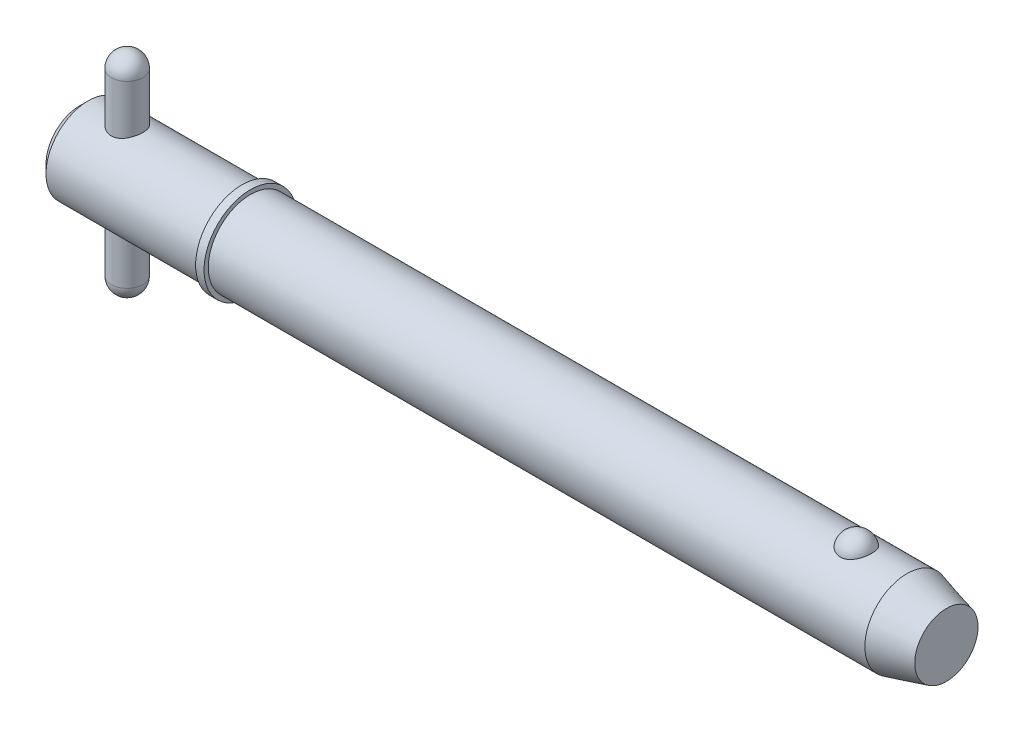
ISO-10303-21;
HEADER;
FILE_DESCRIPTION(('STEP AP214'),'2;1');
FILE_NAME('part.step','',(''),(''),'','','');
FILE_SCHEMA(('AUTOMOTIVE_DESIGN { 1 0 10303 214 1 1 1 1 }'));
ENDSEC;
DATA;
#1=APPLICATION_CONTEXT('core data for automotive mechanical design processes');
#2=APPLICATION_PROTOCOL_DEFINITION('international standard','automotive_design',2000,#1);
#3=PRODUCT_CONTEXT('',#1,'mechanical');
#4=PRODUCT('Part','Part','',(#3));
#5=PRODUCT_RELATED_PRODUCT_CATEGORY('part','',(#4));
#6=PRODUCT_DEFINITION_FORMATION('','',#4);
#7=PRODUCT_DEFINITION_CONTEXT('part definition',#1,'design');
#8=PRODUCT_DEFINITION('design','',#6,#7);
#9=PRODUCT_DEFINITION_SHAPE('','',#8);
#10=(LENGTH_UNIT() NAMED_UNIT(*) SI_UNIT(.MILLI.,.METRE.));
#11=(NAMED_UNIT(*) PLANE_ANGLE_UNIT() SI_UNIT($,.RADIAN.));
#12=(NAMED_UNIT(*) SI_UNIT($,.STERADIAN.) SOLID_ANGLE_UNIT());
#13=UNCERTAINTY_MEASURE_WITH_UNIT(LENGTH_MEASURE(1.E-05),#10,'distance_accuracy_value','');
#14=(GEOMETRIC_REPRESENTATION_CONTEXT(3) GLOBAL_UNCERTAINTY_ASSIGNED_CONTEXT((#13)) GLOBAL_UNIT_ASSIGNED_CONTEXT((#10,
#11,#12)) REPRESENTATION_CONTEXT('',''));
#15=CARTESIAN_POINT('',(0.,0.,0.));
#16=DIRECTION('',(0.,0.,1.));
#17=DIRECTION('',(1.,0.,0.));
#18=AXIS2_PLACEMENT_3D('',#15,#16,#17);
#19=CARTESIAN_POINT('',(7.14,15.875,0.));
#20=DIRECTION('',(0.,-1.,0.));
#21=DIRECTION('',(0.,0.,-1.));
#22=AXIS2_PLACEMENT_3D('',#19,#20,#21);
#23=CYLINDRICAL_SURFACE('',#22,2.38);
#24=CARTESIAN_POINT('',(7.14,-13.495,0.));
#25=DIRECTION('',(0.,-1.,0.));
#26=DIRECTION('',(0.,0.,-1.));
#27=AXIS2_PLACEMENT_3D('',#24,#25,#26);
#28=CIRCLE('',#27,2.38);
#29=CARTESIAN_POINT('',(7.14,-13.495,-2.38));
#30=VERTEX_POINT('',#29);
#31=EDGE_CURVE('P0_E10',#30,#30,#28,.F.);
#32=ORIENTED_EDGE('',*,*,#31,.T.);
#33=EDGE_LOOP('',(#32));
#34=FACE_BOUND('',#33,.T.);
#35=CARTESIAN_POINT('',(7.14,13.495,0.));
#36=DIRECTION('',(0.,-1.,0.));
#37=DIRECTION('',(0.,0.,-1.));
#38=AXIS2_PLACEMENT_3D('',#35,#36,#37);
#39=CIRCLE('',#38,2.38);
#40=CARTESIAN_POINT('',(7.14,13.495,-2.38));
#41=VERTEX_POINT('',#40);
#42=EDGE_CURVE('P0_E21',#41,#41,#39,.T.);
#43=ORIENTED_EDGE('',*,*,#42,.T.);
#44=EDGE_LOOP('',(#43));
#45=FACE_BOUND('',#44,.T.);
#46=ADVANCED_FACE('P0_F14',(#34,#45),#23,.T.);
#47=CARTESIAN_POINT('',(7.14,-13.495,0.));
#48=DIRECTION('',(0.,0.,1.));
#49=DIRECTION('',(1.,0.,0.));
#50=AXIS2_PLACEMENT_3D('',#47,#48,#49);
#51=SPHERICAL_SURFACE('',#50,2.38);
#52=CARTESIAN_POINT('',(7.14,-13.495,0.));
#53=DIRECTION('',(0.,-1.,0.));
#54=DIRECTION('',(0.,0.,-1.));
#55=AXIS2_PLACEMENT_3D('',#52,#53,#54);
#56=SPHERICAL_SURFACE('',#55,2.38);
#57=ORIENTED_EDGE('',*,*,#31,.F.);
#58=EDGE_LOOP('',(#57));
#59=FACE_BOUND('',#58,.T.);
#60=ADVANCED_FACE('P0_F29',(#59),#56,.T.);
#61=CARTESIAN_POINT('',(7.14,13.495,0.));
#62=DIRECTION('',(0.,0.,1.));
#63=DIRECTION('',(1.,0.,0.));
#64=AXIS2_PLACEMENT_3D('',#61,#62,#63);
#65=SPHERICAL_SURFACE('',#64,2.38);
#66=CARTESIAN_POINT('',(7.14,13.495,0.));
#67=DIRECTION('',(0.,-1.,0.));
#68=DIRECTION('',(0.,0.,-1.));
#69=AXIS2_PLACEMENT_3D('',#66,#67,#68);
#70=SPHERICAL_SURFACE('',#69,2.38);
#71=ORIENTED_EDGE('',*,*,#42,.F.);
#72=EDGE_LOOP('',(#71));
#73=FACE_BOUND('',#72,.T.);
#74=ADVANCED_FACE('P0_F16',(#73),#70,.T.);
#75=CLOSED_SHELL('',(#46,#60,#74));
#76=MANIFOLD_SOLID_BREP('P0_B1',#75);
#77=CARTESIAN_POINT('',(0.,0.,0.));
#78=DIRECTION('',(1.,0.,0.));
#79=DIRECTION('',(0.,0.,-1.));
#80=AXIS2_PLACEMENT_3D('',#77,#78,#79);
#81=CYLINDRICAL_SURFACE('',#80,6.35);
#82=CARTESIAN_POINT('',(124.555369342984,0.,0.));
#83=DIRECTION('',(1.,0.,0.));
#84=DIRECTION('',(0.,0.,-1.));
#85=AXIS2_PLACEMENT_3D('',#82,#83,#84);
#86=CIRCLE('',#85,6.35);
#87=CARTESIAN_POINT('',(124.555369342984,0.,-6.35));
#88=VERTEX_POINT('',#87);
#89=EDGE_CURVE('P1_E81',#88,#88,#86,.T.);
#90=ORIENTED_EDGE('',*,*,#89,.F.);
#91=EDGE_LOOP('',(#90));
#92=FACE_BOUND('',#91,.T.);
#93=CARTESIAN_POINT('',(25.7,0.,0.));
#94=DIRECTION('',(1.,0.,0.));
#95=DIRECTION('',(0.,0.,-1.));
#96=AXIS2_PLACEMENT_3D('',#93,#94,#95);
#97=CIRCLE('',#96,6.35);
#98=CARTESIAN_POINT('',(25.7,0.,-6.35));
#99=VERTEX_POINT('',#98);
#100=EDGE_CURVE('P1_E85',#99,#99,#97,.T.);
#101=ORIENTED_EDGE('',*,*,#100,.T.);
#102=EDGE_LOOP('',(#101));
#103=FACE_BOUND('',#102,.T.);
#104=CARTESIAN_POINT('',(116.930021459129,5.87502187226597,2.40969251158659));
#105=CARTESIAN_POINT('',(116.805030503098,5.87501645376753,2.40969773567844));
#106=CARTESIAN_POINT('',(116.680080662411,5.87916061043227,2.39967292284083));
#107=CARTESIAN_POINT('',(116.433909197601,5.8952311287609,2.35991730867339));
#108=CARTESIAN_POINT('',(116.312686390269,5.90715499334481,2.33019283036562));
#109=CARTESIAN_POINT('',(116.077517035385,5.93739567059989,2.25201402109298));
#110=CARTESIAN_POINT('',(115.963560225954,5.95570321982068,2.2035868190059));
#111=CARTESIAN_POINT('',(115.74557352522,5.99672067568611,2.08937987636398));
#112=CARTESIAN_POINT('',(115.641545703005,6.01943149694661,2.02359652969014));
#113=CARTESIAN_POINT('',(115.442943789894,6.06760647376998,1.87428969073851));
#114=CARTESIAN_POINT('',(115.348726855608,6.09313095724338,1.79031110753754));
#115=CARTESIAN_POINT('',(115.175255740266,6.14375873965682,1.60800178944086));
#116=CARTESIAN_POINT('',(115.096004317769,6.16886196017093,1.50966841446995));
#117=CARTESIAN_POINT('',(114.950845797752,6.21724600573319,1.29645884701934));
#118=CARTESIAN_POINT('',(114.885688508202,6.24039621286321,1.18104158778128));
#119=CARTESIAN_POINT('',(114.774703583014,6.28117277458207,0.940351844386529));
#120=CARTESIAN_POINT('',(114.728877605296,6.29879865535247,0.815078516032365));
#121=CARTESIAN_POINT('',(114.657023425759,6.32692073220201,0.556494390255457));
#122=CARTESIAN_POINT('',(114.631249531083,6.33732517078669,0.423102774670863));
#123=CARTESIAN_POINT('',(114.600988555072,6.34957673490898,0.153542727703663));
#124=CARTESIAN_POINT('',(114.596500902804,6.35142408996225,0.0173743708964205));
#125=CARTESIAN_POINT('',(114.608865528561,6.34638925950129,-0.253036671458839));
#126=CARTESIAN_POINT('',(114.625594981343,6.33955731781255,-0.387285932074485));
#127=CARTESIAN_POINT('',(114.679843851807,6.31794129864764,-0.650851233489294));
#128=CARTESIAN_POINT('',(114.717363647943,6.30315707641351,-0.780167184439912));
#129=CARTESIAN_POINT('',(114.812500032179,6.26711642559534,-1.03041949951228));
#130=CARTESIAN_POINT('',(114.870143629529,6.24585130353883,-1.15134433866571));
#131=CARTESIAN_POINT('',(115.004352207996,6.19905619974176,-1.38129800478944));
#132=CARTESIAN_POINT('',(115.080918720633,6.17352587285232,-1.49032586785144));
#133=CARTESIAN_POINT('',(115.251753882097,6.12080227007,-1.69393164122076));
#134=CARTESIAN_POINT('',(115.346100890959,6.09360200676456,-1.78844209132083));
#135=CARTESIAN_POINT('',(115.550119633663,6.04070434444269,-1.95970536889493));
#136=CARTESIAN_POINT('',(115.659790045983,6.01500681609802,-2.03645972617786));
#137=CARTESIAN_POINT('',(115.889187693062,5.96867714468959,-2.1684564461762));
#138=CARTESIAN_POINT('',(116.008652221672,5.94794910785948,-2.2241206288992));
#139=CARTESIAN_POINT('',(116.256218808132,5.91340580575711,-2.31440992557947));
#140=CARTESIAN_POINT('',(116.384317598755,5.89958794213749,-2.34904294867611));
#141=CARTESIAN_POINT('',(116.638582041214,5.88111049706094,-2.39491590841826));
#142=CARTESIAN_POINT('',(116.764520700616,5.87602512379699,-2.40724512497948));
#143=CARTESIAN_POINT('',(117.016786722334,5.87428980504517,-2.41147867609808));
#144=CARTESIAN_POINT('',(117.143114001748,5.87763817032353,-2.40338710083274));
#145=CARTESIAN_POINT('',(117.388417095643,5.89212921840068,-2.36762715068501));
#146=CARTESIAN_POINT('',(117.507499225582,5.90302431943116,-2.34058030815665));
#147=CARTESIAN_POINT('',(117.73924472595,5.93113752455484,-2.26839066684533));
#148=CARTESIAN_POINT('',(117.851907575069,5.94835614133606,-2.22324640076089));
#149=CARTESIAN_POINT('',(118.070400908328,5.98773016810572,-2.11493806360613));
#150=CARTESIAN_POINT('',(118.176028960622,6.00998499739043,-2.05140269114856));
#151=CARTESIAN_POINT('',(118.375300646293,6.05690144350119,-1.90842705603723));
#152=CARTESIAN_POINT('',(118.468941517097,6.08156361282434,-1.8289831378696));
#153=CARTESIAN_POINT('',(118.646675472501,6.13211715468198,-1.65182429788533));
#154=CARTESIAN_POINT('',(118.730055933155,6.15800825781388,-1.55339381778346));
#155=CARTESIAN_POINT('',(118.879790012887,6.20712834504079,-1.34374214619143));
#156=CARTESIAN_POINT('',(118.946140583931,6.23035685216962,-1.23251867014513));
#157=CARTESIAN_POINT('',(119.062345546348,6.27251177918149,-0.99644720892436));
#158=CARTESIAN_POINT('',(119.111607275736,6.29127762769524,-0.871278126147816));
#159=CARTESIAN_POINT('',(119.189614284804,6.3215862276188,-0.613870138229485));
#160=CARTESIAN_POINT('',(119.218359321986,6.33312889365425,-0.481631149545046));
#161=CARTESIAN_POINT('',(119.25477058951,6.34782349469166,-0.213672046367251));
#162=CARTESIAN_POINT('',(119.262413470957,6.35096613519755,-0.0779482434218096));
#163=CARTESIAN_POINT('',(119.256395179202,6.34851322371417,0.192943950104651));
#164=CARTESIAN_POINT('',(119.242734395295,6.3429178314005,0.328112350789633));
#165=CARTESIAN_POINT('',(119.19450361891,6.32360512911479,0.593406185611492));
#166=CARTESIAN_POINT('',(119.160031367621,6.30992579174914,0.723552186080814));
#167=CARTESIAN_POINT('',(119.070953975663,6.27586325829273,0.975834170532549));
#168=CARTESIAN_POINT('',(119.01634761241,6.25547965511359,1.09796966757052));
#169=CARTESIAN_POINT('',(118.88775879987,6.20998183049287,1.33148921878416));
#170=CARTESIAN_POINT('',(118.813674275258,6.18484288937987,1.44281227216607));
#171=CARTESIAN_POINT('',(118.647820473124,6.13258735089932,1.65087683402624));
#172=CARTESIAN_POINT('',(118.556051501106,6.10547078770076,1.74761859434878));
#173=CARTESIAN_POINT('',(118.357183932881,6.0523587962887,1.92350926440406));
#174=CARTESIAN_POINT('',(118.250133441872,6.0263601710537,2.00271146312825));
#175=CARTESIAN_POINT('',(118.023138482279,5.97843747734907,2.14154159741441));
#176=CARTESIAN_POINT('',(117.903191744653,5.95651412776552,2.20116608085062));
#177=CARTESIAN_POINT('',(117.644523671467,5.91812106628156,2.30250570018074));
#178=CARTESIAN_POINT('',(117.50506980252,5.90217533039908,2.34256795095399));
#179=CARTESIAN_POINT('',(117.220397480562,5.88063128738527,2.39615214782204));
#180=CARTESIAN_POINT('',(117.07518174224,5.8750281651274,2.40968644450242));
#181=CARTESIAN_POINT('',(116.930021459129,5.87502187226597,2.40969251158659));
#182=B_SPLINE_CURVE_WITH_KNOTS('',3,(#104,#105,#106,#107,#108,#109,#110,#111,#112,#113,#114,
#115,#116,#117,#118,#119,#120,#121,#122,#123,#124,#125,#126,#127,#128,#129,#130,#131,#132,#133,
#134,#135,#136,#137,#138,#139,#140,#141,#142,#143,#144,#145,#146,#147,#148,#149,#150,#151,#152,
#153,#154,#155,#156,#157,#158,#159,#160,#161,#162,#163,#164,#165,#166,#167,#168,#169,#170,#171,
#172,#173,#174,#175,#176,#177,#178,#179,#180,#181),.UNSPECIFIED.,.T.,.F.,(4,2,2,2,2,2,2,2,2,2,2,
2,2,2,2,2,2,2,2,2,2,2,2,2,2,2,2,2,2,2,2,2,2,2,2,2,2,2,4),(0.,0.374440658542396,
0.748761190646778,1.12254078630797,1.49639810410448,1.88098871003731,2.26565013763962,
2.66741104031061,3.06920639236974,3.47601794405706,3.88281858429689,4.28727498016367,
4.69173873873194,5.09674745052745,5.50178895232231,5.90865911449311,6.31549420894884,
6.71369855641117,7.11175305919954,7.48978077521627,7.86773278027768,8.23383886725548,
8.59997464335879,8.97409044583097,9.34829231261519,9.74122667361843,10.1342313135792,
10.5397522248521,10.9452779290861,11.3512521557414,11.7572189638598,12.1612938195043,
12.5653932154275,12.9716540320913,13.3779078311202,13.7829098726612,14.1879832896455,
14.6230486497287,15.0579114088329),.UNSPECIFIED.);
#183=CARTESIAN_POINT('',(116.930021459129,5.87502187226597,2.40969251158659));
#184=VERTEX_POINT('',#183);
#185=EDGE_CURVE('P1_E35',#184,#184,#182,.T.);
#186=ORIENTED_EDGE('',*,*,#185,.T.);
#187=EDGE_LOOP('',(#186));
#188=FACE_BOUND('',#187,.T.);
#189=ADVANCED_FACE('P1_F13',(#92,#103,#188),#81,.T.);
#190=CARTESIAN_POINT('',(0.,0.,0.));
#191=DIRECTION('',(-1.,0.,0.));
#192=DIRECTION('',(0.,0.,1.));
#193=AXIS2_PLACEMENT_3D('',#190,#191,#192);
#194=PLANE('',#193);
#195=CARTESIAN_POINT('',(0.,0.,0.));
#196=DIRECTION('',(1.,0.,0.));
#197=DIRECTION('',(0.,0.,-1.));
#198=AXIS2_PLACEMENT_3D('',#195,#196,#197);
#199=CIRCLE('',#198,5.08);
#200=CARTESIAN_POINT('',(0.,0.,-5.08));
#201=VERTEX_POINT('',#200);
#202=EDGE_CURVE('P1_E9',#201,#201,#199,.T.);
#203=ORIENTED_EDGE('',*,*,#202,.F.);
#204=EDGE_LOOP('',(#203));
#205=FACE_BOUND('',#204,.T.);
#206=ADVANCED_FACE('P1_F15',(#205),#194,.T.);
#207=CARTESIAN_POINT('',(1.27,0.,0.));
#208=DIRECTION('',(1.,0.,0.));
#209=DIRECTION('',(0.,0.,-1.));
#210=AXIS2_PLACEMENT_3D('',#207,#208,#209);
#211=CONICAL_SURFACE('',#210,6.35,0.78539816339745);
#212=ORIENTED_EDGE('',*,*,#202,.T.);
#213=EDGE_LOOP('',(#212));
#214=FACE_BOUND('',#213,.T.);
#215=CARTESIAN_POINT('',(1.27,0.,0.));
#216=DIRECTION('',(1.,0.,0.));
#217=DIRECTION('',(0.,0.,-1.));
#218=AXIS2_PLACEMENT_3D('',#215,#216,#217);
#219=CIRCLE('',#218,6.35);
#220=CARTESIAN_POINT('',(1.27,0.,-6.35));
#221=VERTEX_POINT('',#220);
#222=EDGE_CURVE('P1_E26',#221,#221,#219,.T.);
#223=ORIENTED_EDGE('',*,*,#222,.F.);
#224=EDGE_LOOP('',(#223));
#225=FACE_BOUND('',#224,.T.);
#226=ADVANCED_FACE('P1_F77',(#214,#225),#211,.T.);
#227=CARTESIAN_POINT('',(0.,0.,0.));
#228=DIRECTION('',(1.,0.,0.));
#229=DIRECTION('',(0.,0.,-1.));
#230=AXIS2_PLACEMENT_3D('',#227,#228,#229);
#231=CYLINDRICAL_SURFACE('',#230,6.35);
#232=CARTESIAN_POINT('',(7.14,-5.88711304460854,2.38));
#233=CARTESIAN_POINT('',(7.01146258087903,-5.88710856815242,2.38000480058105));
#234=CARTESIAN_POINT('',(6.88295682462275,-5.89136840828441,2.36955244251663));
#235=CARTESIAN_POINT('',(6.62981934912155,-5.90782785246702,2.32820953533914));
#236=CARTESIAN_POINT('',(6.50518751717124,-5.92002722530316,2.29731958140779));
#237=CARTESIAN_POINT('',(6.26352403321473,-5.95079384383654,2.21639366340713));
#238=CARTESIAN_POINT('',(6.14647496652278,-5.96934583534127,2.16640353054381));
#239=CARTESIAN_POINT('',(5.92237941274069,-6.01070278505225,2.04885862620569));
#240=CARTESIAN_POINT('',(5.81533593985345,-6.03350901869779,1.98129858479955));
#241=CARTESIAN_POINT('',(5.60897525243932,-6.08207341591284,1.82693902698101));
#242=CARTESIAN_POINT('',(5.51022503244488,-6.10791836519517,1.73940861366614));
#243=CARTESIAN_POINT('',(5.32840561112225,-6.15892405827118,1.54914379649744));
#244=CARTESIAN_POINT('',(5.24533975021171,-6.1840846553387,1.44640616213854));
#245=CARTESIAN_POINT('',(5.09451639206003,-6.23191821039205,1.22434014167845));
#246=CARTESIAN_POINT('',(5.02737511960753,-6.25447755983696,1.10456656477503));
#247=CARTESIAN_POINT('',(4.91443001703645,-6.2935236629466,0.854429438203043));
#248=CARTESIAN_POINT('',(4.86861879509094,-6.31001251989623,0.724069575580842));
#249=CARTESIAN_POINT('',(4.80162253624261,-6.33444370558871,0.46242122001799));
#250=CARTESIAN_POINT('',(4.77946137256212,-6.34272370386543,0.331414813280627));
#251=CARTESIAN_POINT('',(4.75726677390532,-6.35101600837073,0.0672982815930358));
#252=CARTESIAN_POINT('',(4.75722615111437,-6.35103100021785,-0.0658111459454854));
#253=CARTESIAN_POINT('',(4.77870510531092,-6.3430064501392,-0.323358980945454));
#254=CARTESIAN_POINT('',(4.79915922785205,-6.33536494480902,-0.447900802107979));
#255=CARTESIAN_POINT('',(4.85925493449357,-6.31340794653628,-0.69163609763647));
#256=CARTESIAN_POINT('',(4.89889787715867,-6.29909198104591,-0.810829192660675));
#257=CARTESIAN_POINT('',(4.9967414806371,-6.26494471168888,-1.04254212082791));
#258=CARTESIAN_POINT('',(5.05520370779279,-6.24503620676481,-1.1549396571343));
#259=CARTESIAN_POINT('',(5.1887948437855,-6.20171869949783,-1.3686079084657));
#260=CARTESIAN_POINT('',(5.26392912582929,-6.17830856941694,-1.46987502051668));
#261=CARTESIAN_POINT('',(5.43386591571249,-6.12878580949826,-1.66468415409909));
#262=CARTESIAN_POINT('',(5.52956139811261,-6.10259519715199,-1.75742857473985));
#263=CARTESIAN_POINT('',(5.73530435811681,-6.05155777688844,-1.92585331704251));
#264=CARTESIAN_POINT('',(5.84535542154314,-6.02671130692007,-2.00152936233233));
#265=CARTESIAN_POINT('',(6.07982989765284,-5.98068420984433,-2.13519109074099));
#266=CARTESIAN_POINT('',(6.20451768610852,-5.95959698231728,-2.19274775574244));
#267=CARTESIAN_POINT('',(6.4628145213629,-5.92455622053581,-2.28574558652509));
#268=CARTESIAN_POINT('',(6.59641856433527,-5.91059872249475,-2.32119904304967));
#269=CARTESIAN_POINT('',(6.86087441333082,-5.8923327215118,-2.36717069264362));
#270=CARTESIAN_POINT('',(6.99147192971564,-5.8875347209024,-2.37895573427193));
#271=CARTESIAN_POINT('',(7.25283805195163,-5.88674545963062,-2.38091046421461));
#272=CARTESIAN_POINT('',(7.38360660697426,-5.89075200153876,-2.37108554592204));
#273=CARTESIAN_POINT('',(7.63510696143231,-5.90662331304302,-2.33124781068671));
#274=CARTESIAN_POINT('',(7.75602069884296,-5.91810660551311,-2.30221396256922));
#275=CARTESIAN_POINT('',(7.99120505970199,-5.94718527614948,-2.22601401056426));
#276=CARTESIAN_POINT('',(8.10547431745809,-5.96478190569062,-2.17884419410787));
#277=CARTESIAN_POINT('',(8.32888632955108,-6.00491533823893,-2.06572311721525));
#278=CARTESIAN_POINT('',(8.43767672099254,-6.02761250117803,-1.99913452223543));
#279=CARTESIAN_POINT('',(8.6429894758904,-6.07511988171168,-1.84974438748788));
#280=CARTESIAN_POINT('',(8.73950733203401,-6.09993087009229,-1.76693691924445));
#281=CARTESIAN_POINT('',(8.9238741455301,-6.1507686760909,-1.58125563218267));
#282=CARTESIAN_POINT('',(9.01078732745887,-6.17677301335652,-1.47744327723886));
#283=CARTESIAN_POINT('',(9.16607127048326,-6.22556172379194,-1.25606967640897));
#284=CARTESIAN_POINT('',(9.23444197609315,-6.24834608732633,-1.13850838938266));
#285=CARTESIAN_POINT('',(9.3502493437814,-6.28811144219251,-0.893050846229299));
#286=CARTESIAN_POINT('',(9.39775808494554,-6.30511236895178,-0.765192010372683));
#287=CARTESIAN_POINT('',(9.47032640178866,-6.33145833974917,-0.502514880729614));
#288=CARTESIAN_POINT('',(9.49539651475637,-6.34080697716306,-0.367699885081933));
#289=CARTESIAN_POINT('',(9.52124059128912,-6.35045496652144,-0.103396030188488));
#290=CARTESIAN_POINT('',(9.52334421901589,-6.35124952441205,0.025945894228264));
#291=CARTESIAN_POINT('',(9.50661518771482,-6.34499064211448,0.283061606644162));
#292=CARTESIAN_POINT('',(9.48778504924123,-6.33793814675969,0.410835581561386));
#293=CARTESIAN_POINT('',(9.43065630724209,-6.31700307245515,0.658028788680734));
#294=CARTESIAN_POINT('',(9.39284291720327,-6.30329098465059,0.7775756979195));
#295=CARTESIAN_POINT('',(9.29930406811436,-6.27046903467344,1.00863789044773));
#296=CARTESIAN_POINT('',(9.2435752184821,-6.25135815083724,1.12015164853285));
#297=CARTESIAN_POINT('',(9.11312349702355,-6.20865254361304,1.33711407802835));
#298=CARTESIAN_POINT('',(9.03770094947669,-6.18490316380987,1.44211105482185));
#299=CARTESIAN_POINT('',(8.87110640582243,-6.13583718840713,1.63836897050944));
#300=CARTESIAN_POINT('',(8.77992879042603,-6.11052003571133,1.72962498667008));
#301=CARTESIAN_POINT('',(8.57869799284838,-6.05953829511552,1.90076098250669));
#302=CARTESIAN_POINT('',(8.46790320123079,-6.03392573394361,1.97978778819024));
#303=CARTESIAN_POINT('',(8.23379693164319,-5.98676607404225,2.11813466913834));
#304=CARTESIAN_POINT('',(8.11048418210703,-5.9652193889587,2.17745273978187));
#305=CARTESIAN_POINT('',(7.84900037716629,-5.92818393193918,2.27641807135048));
#306=CARTESIAN_POINT('',(7.71041678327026,-5.91299857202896,2.31510015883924));
#307=CARTESIAN_POINT('',(7.42787316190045,-5.89246887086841,2.36688002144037));
#308=CARTESIAN_POINT('',(7.28391673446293,-5.88711805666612,2.37999462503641));
#309=CARTESIAN_POINT('',(7.14,-5.88711304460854,2.38));
#310=B_SPLINE_CURVE_WITH_KNOTS('',3,(#232,#233,#234,#235,#236,#237,#238,#239,#240,#241,#242,
#243,#244,#245,#246,#247,#248,#249,#250,#251,#252,#253,#254,#255,#256,#257,#258,#259,#260,#261,
#262,#263,#264,#265,#266,#267,#268,#269,#270,#271,#272,#273,#274,#275,#276,#277,#278,#279,#280,
#281,#282,#283,#284,#285,#286,#287,#288,#289,#290,#291,#292,#293,#294,#295,#296,#297,#298,#299,
#300,#301,#302,#303,#304,#305,#306,#307,#308,#309),.UNSPECIFIED.,.T.,.F.,(4,2,2,2,2,2,2,2,2,2,2,
2,2,2,2,2,2,2,2,2,2,2,2,2,2,2,2,2,2,2,2,2,2,2,2,2,2,2,4),(0.,0.385076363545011,
0.770141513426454,1.15428843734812,1.53855071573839,1.94016118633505,2.3418570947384,
2.75720522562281,3.1724093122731,3.569721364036,3.96690431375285,4.34445758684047,
4.72203759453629,5.10511017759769,5.48830640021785,5.89390240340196,6.29959991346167,
6.71428455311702,7.12873839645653,7.52034494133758,7.91185376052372,8.28480528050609,
8.65783318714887,9.0448340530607,9.43197664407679,9.84363087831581,10.2552863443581,
10.6655081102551,11.0755371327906,11.4616919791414,11.847800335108,12.224507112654,
12.6012852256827,12.9938941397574,13.386643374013,13.8000944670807,14.2135876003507,
14.6450218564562,15.0761720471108),.UNSPECIFIED.);
#311=CARTESIAN_POINT('',(7.14,-5.88711304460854,2.38));
#312=VERTEX_POINT('',#311);
#313=EDGE_CURVE('P1_E17',#312,#312,#310,.T.);
#314=ORIENTED_EDGE('',*,*,#313,.F.);
#315=EDGE_LOOP('',(#314));
#316=FACE_BOUND('',#315,.T.);
#317=CARTESIAN_POINT('',(7.14,5.88711304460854,2.38));
#318=CARTESIAN_POINT('',(7.26853741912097,5.88710856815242,2.38000480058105));
#319=CARTESIAN_POINT('',(7.39704317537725,5.89136840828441,2.36955244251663));
#320=CARTESIAN_POINT('',(7.65018065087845,5.90782785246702,2.32820953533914));
#321=CARTESIAN_POINT('',(7.77481248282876,5.92002722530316,2.29731958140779));
#322=CARTESIAN_POINT('',(8.01647596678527,5.95079384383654,2.21639366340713));
#323=CARTESIAN_POINT('',(8.13352503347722,5.96934583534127,2.16640353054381));
#324=CARTESIAN_POINT('',(8.35762058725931,6.01070278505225,2.04885862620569));
#325=CARTESIAN_POINT('',(8.46466406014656,6.03350901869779,1.98129858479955));
#326=CARTESIAN_POINT('',(8.67102474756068,6.08207341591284,1.82693902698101));
#327=CARTESIAN_POINT('',(8.76977496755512,6.10791836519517,1.73940861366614));
#328=CARTESIAN_POINT('',(8.95159438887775,6.15892405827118,1.54914379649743));
#329=CARTESIAN_POINT('',(9.03466024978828,6.1840846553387,1.44640616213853));
#330=CARTESIAN_POINT('',(9.18548360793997,6.23191821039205,1.22434014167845));
#331=CARTESIAN_POINT('',(9.25262488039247,6.25447755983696,1.10456656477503));
#332=CARTESIAN_POINT('',(9.36556998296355,6.2935236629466,0.854429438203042));
#333=CARTESIAN_POINT('',(9.41138120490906,6.31001251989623,0.72406957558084));
#334=CARTESIAN_POINT('',(9.47837746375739,6.33444370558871,0.462421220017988));
#335=CARTESIAN_POINT('',(9.50053862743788,6.34272370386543,0.331414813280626));
#336=CARTESIAN_POINT('',(9.52273322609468,6.35101600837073,0.0672982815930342));
#337=CARTESIAN_POINT('',(9.52277384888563,6.35103100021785,-0.0658111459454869));
#338=CARTESIAN_POINT('',(9.50129489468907,6.3430064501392,-0.323358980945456));
#339=CARTESIAN_POINT('',(9.48084077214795,6.33536494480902,-0.447900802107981));
#340=CARTESIAN_POINT('',(9.42074506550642,6.31340794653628,-0.691636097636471));
#341=CARTESIAN_POINT('',(9.38110212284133,6.29909198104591,-0.810829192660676));
#342=CARTESIAN_POINT('',(9.2832585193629,6.26494471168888,-1.04254212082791));
#343=CARTESIAN_POINT('',(9.22479629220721,6.24503620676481,-1.1549396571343));
#344=CARTESIAN_POINT('',(9.0912051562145,6.20171869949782,-1.3686079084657));
#345=CARTESIAN_POINT('',(9.0160708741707,6.17830856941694,-1.46987502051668));
#346=CARTESIAN_POINT('',(8.84613408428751,6.12878580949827,-1.66468415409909));
#347=CARTESIAN_POINT('',(8.75043860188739,6.10259519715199,-1.75742857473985));
#348=CARTESIAN_POINT('',(8.54469564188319,6.05155777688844,-1.92585331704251));
#349=CARTESIAN_POINT('',(8.43464457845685,6.02671130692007,-2.00152936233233));
#350=CARTESIAN_POINT('',(8.20017010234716,5.98068420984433,-2.13519109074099));
#351=CARTESIAN_POINT('',(8.07548231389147,5.95959698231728,-2.19274775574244));
#352=CARTESIAN_POINT('',(7.8171854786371,5.9245562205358,-2.28574558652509));
#353=CARTESIAN_POINT('',(7.68358143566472,5.91059872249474,-2.32119904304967));
#354=CARTESIAN_POINT('',(7.41912558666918,5.8923327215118,-2.36717069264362));
#355=CARTESIAN_POINT('',(7.28852807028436,5.8875347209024,-2.37895573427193));
#356=CARTESIAN_POINT('',(7.02716194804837,5.88674545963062,-2.38091046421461));
#357=CARTESIAN_POINT('',(6.89639339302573,5.89075200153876,-2.37108554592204));
#358=CARTESIAN_POINT('',(6.64489303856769,5.90662331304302,-2.33124781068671));
#359=CARTESIAN_POINT('',(6.52397930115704,5.91810660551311,-2.30221396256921));
#360=CARTESIAN_POINT('',(6.288794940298,5.94718527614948,-2.22601401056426));
#361=CARTESIAN_POINT('',(6.17452568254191,5.96478190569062,-2.17884419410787));
#362=CARTESIAN_POINT('',(5.95111367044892,6.00491533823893,-2.06572311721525));
#363=CARTESIAN_POINT('',(5.84232327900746,6.02761250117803,-1.99913452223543));
#364=CARTESIAN_POINT('',(5.6370105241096,6.07511988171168,-1.84974438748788));
#365=CARTESIAN_POINT('',(5.54049266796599,6.09993087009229,-1.76693691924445));
#366=CARTESIAN_POINT('',(5.3561258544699,6.1507686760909,-1.58125563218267));
#367=CARTESIAN_POINT('',(5.26921267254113,6.17677301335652,-1.47744327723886));
#368=CARTESIAN_POINT('',(5.11392872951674,6.22556172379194,-1.25606967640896));
#369=CARTESIAN_POINT('',(5.04555802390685,6.24834608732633,-1.13850838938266));
#370=CARTESIAN_POINT('',(4.9297506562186,6.28811144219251,-0.893050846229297));
#371=CARTESIAN_POINT('',(4.88224191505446,6.30511236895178,-0.76519201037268));
#372=CARTESIAN_POINT('',(4.80967359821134,6.33145833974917,-0.502514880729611));
#373=CARTESIAN_POINT('',(4.78460348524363,6.34080697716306,-0.36769988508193));
#374=CARTESIAN_POINT('',(4.75875940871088,6.35045496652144,-0.103396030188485));
#375=CARTESIAN_POINT('',(4.75665578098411,6.35124952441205,0.025945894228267));
#376=CARTESIAN_POINT('',(4.77338481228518,6.34499064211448,0.283061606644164));
#377=CARTESIAN_POINT('',(4.79221495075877,6.33793814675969,0.410835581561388));
#378=CARTESIAN_POINT('',(4.84934369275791,6.31700307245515,0.658028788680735));
#379=CARTESIAN_POINT('',(4.88715708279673,6.30329098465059,0.777575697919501));
#380=CARTESIAN_POINT('',(4.98069593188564,6.27046903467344,1.00863789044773));
#381=CARTESIAN_POINT('',(5.0364247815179,6.25135815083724,1.12015164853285));
#382=CARTESIAN_POINT('',(5.16687650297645,6.20865254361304,1.33711407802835));
#383=CARTESIAN_POINT('',(5.24229905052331,6.18490316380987,1.44211105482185));
#384=CARTESIAN_POINT('',(5.40889359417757,6.13583718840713,1.63836897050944));
#385=CARTESIAN_POINT('',(5.50007120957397,6.11052003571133,1.72962498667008));
#386=CARTESIAN_POINT('',(5.70130200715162,6.05953829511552,1.90076098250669));
#387=CARTESIAN_POINT('',(5.81209679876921,6.03392573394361,1.97978778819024));
#388=CARTESIAN_POINT('',(6.04620306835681,5.98676607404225,2.11813466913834));
#389=CARTESIAN_POINT('',(6.16951581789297,5.9652193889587,2.17745273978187));
#390=CARTESIAN_POINT('',(6.43099962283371,5.92818393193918,2.27641807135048));
#391=CARTESIAN_POINT('',(6.56958321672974,5.91299857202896,2.31510015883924));
#392=CARTESIAN_POINT('',(6.85212683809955,5.89246887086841,2.36688002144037));
#393=CARTESIAN_POINT('',(6.99608326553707,5.88711805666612,2.37999462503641));
#394=CARTESIAN_POINT('',(7.14,5.88711304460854,2.38));
#395=B_SPLINE_CURVE_WITH_KNOTS('',3,(#317,#318,#319,#320,#321,#322,#323,#324,#325,#326,#327,
#328,#329,#330,#331,#332,#333,#334,#335,#336,#337,#338,#339,#340,#341,#342,#343,#344,#345,#346,
#347,#348,#349,#350,#351,#352,#353,#354,#355,#356,#357,#358,#359,#360,#361,#362,#363,#364,#365,
#366,#367,#368,#369,#370,#371,#372,#373,#374,#375,#376,#377,#378,#379,#380,#381,#382,#383,#384,
#385,#386,#387,#388,#389,#390,#391,#392,#393,#394),.UNSPECIFIED.,.T.,.F.,(4,2,2,2,2,2,2,2,2,2,2,
2,2,2,2,2,2,2,2,2,2,2,2,2,2,2,2,2,2,2,2,2,2,2,2,2,2,2,4),(0.,0.385076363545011,
0.770141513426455,1.15428843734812,1.53855071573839,1.94016118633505,2.3418570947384,
2.75720522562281,3.1724093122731,3.56972136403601,3.96690431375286,4.34445758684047,
4.72203759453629,5.10511017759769,5.48830640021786,5.89390240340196,6.29959991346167,
6.71428455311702,7.12873839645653,7.52034494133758,7.91185376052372,8.2848052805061,
8.65783318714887,9.0448340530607,9.43197664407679,9.84363087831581,10.2552863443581,
10.6655081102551,11.0755371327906,11.4616919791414,11.847800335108,12.2245071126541,
12.6012852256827,12.9938941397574,13.386643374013,13.8000944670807,14.2135876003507,
14.6450218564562,15.0761720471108),.UNSPECIFIED.);
#396=CARTESIAN_POINT('',(7.14,5.88711304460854,2.38));
#397=VERTEX_POINT('',#396);
#398=EDGE_CURVE('P1_E43',#397,#397,#395,.T.);
#399=ORIENTED_EDGE('',*,*,#398,.F.);
#400=EDGE_LOOP('',(#399));
#401=FACE_BOUND('',#400,.T.);
#402=ORIENTED_EDGE('',*,*,#222,.T.);
#403=EDGE_LOOP('',(#402));
#404=FACE_BOUND('',#403,.T.);
#405=CARTESIAN_POINT('',(24.43,0.,0.));
#406=DIRECTION('',(1.,0.,0.));
#407=DIRECTION('',(0.,0.,-1.));
#408=AXIS2_PLACEMENT_3D('',#405,#406,#407);
#409=CIRCLE('',#408,6.35);
#410=CARTESIAN_POINT('',(24.43,0.,-6.35));
#411=VERTEX_POINT('',#410);
#412=EDGE_CURVE('P1_E31',#411,#411,#409,.T.);
#413=ORIENTED_EDGE('',*,*,#412,.F.);
#414=EDGE_LOOP('',(#413));
#415=FACE_BOUND('',#414,.T.);
#416=ADVANCED_FACE('P1_F103',(#316,#401,#404,#415),#231,.T.);
#417=CARTESIAN_POINT('',(24.43,6.35,0.));
#418=DIRECTION('',(-1.,0.,0.));
#419=DIRECTION('',(0.,0.,1.));
#420=AXIS2_PLACEMENT_3D('',#417,#418,#419);
#421=PLANE('',#420);
#422=ORIENTED_EDGE('',*,*,#412,.T.);
#423=EDGE_LOOP('',(#422));
#424=FACE_BOUND('',#423,.T.);
#425=CARTESIAN_POINT('',(24.43,0.,0.));
#426=DIRECTION('',(1.,0.,0.));
#427=DIRECTION('',(0.,0.,-1.));
#428=AXIS2_PLACEMENT_3D('',#425,#426,#427);
#429=CIRCLE('',#428,6.985);
#430=CARTESIAN_POINT('',(24.43,0.,-6.985));
#431=VERTEX_POINT('',#430);
#432=EDGE_CURVE('P1_E91',#431,#431,#429,.T.);
#433=ORIENTED_EDGE('',*,*,#432,.F.);
#434=EDGE_LOOP('',(#433));
#435=FACE_BOUND('',#434,.T.);
#436=ADVANCED_FACE('P1_F100',(#424,#435),#421,.T.);
#437=CARTESIAN_POINT('',(0.,0.,0.));
#438=DIRECTION('',(1.,0.,0.));
#439=DIRECTION('',(0.,0.,-1.));
#440=AXIS2_PLACEMENT_3D('',#437,#438,#439);
#441=CYLINDRICAL_SURFACE('',#440,6.985);
#442=ORIENTED_EDGE('',*,*,#432,.T.);
#443=EDGE_LOOP('',(#442));
#444=FACE_BOUND('',#443,.T.);
#445=CARTESIAN_POINT('',(25.7,0.,0.));
#446=DIRECTION('',(1.,0.,0.));
#447=DIRECTION('',(0.,0.,-1.));
#448=AXIS2_PLACEMENT_3D('',#445,#446,#447);
#449=CIRCLE('',#448,6.985);
#450=CARTESIAN_POINT('',(25.7,0.,-6.985));
#451=VERTEX_POINT('',#450);
#452=EDGE_CURVE('P1_E88',#451,#451,#449,.T.);
#453=ORIENTED_EDGE('',*,*,#452,.F.);
#454=EDGE_LOOP('',(#453));
#455=FACE_BOUND('',#454,.T.);
#456=ADVANCED_FACE('P1_F68',(#444,#455),#441,.T.);
#457=CARTESIAN_POINT('',(25.7,6.985,0.));
#458=DIRECTION('',(1.,0.,0.));
#459=DIRECTION('',(0.,0.,-1.));
#460=AXIS2_PLACEMENT_3D('',#457,#458,#459);
#461=PLANE('',#460);
#462=ORIENTED_EDGE('',*,*,#452,.T.);
#463=EDGE_LOOP('',(#462));
#464=FACE_BOUND('',#463,.T.);
#465=ORIENTED_EDGE('',*,*,#100,.F.);
#466=EDGE_LOOP('',(#465));
#467=FACE_BOUND('',#466,.T.);
#468=ADVANCED_FACE('P1_F62',(#464,#467),#461,.T.);
#469=CARTESIAN_POINT('',(130.48,0.,0.));
#470=DIRECTION('',(-1.,0.,0.));
#471=DIRECTION('',(0.,0.,1.));
#472=AXIS2_PLACEMENT_3D('',#469,#470,#471);
#473=CONICAL_SURFACE('',#472,4.76250000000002,0.26179938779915);
#474=ORIENTED_EDGE('',*,*,#89,.T.);
#475=EDGE_LOOP('',(#474));
#476=FACE_BOUND('',#475,.T.);
#477=CARTESIAN_POINT('',(130.48,0.,0.));
#478=DIRECTION('',(1.,0.,0.));
#479=DIRECTION('',(0.,0.,-1.));
#480=AXIS2_PLACEMENT_3D('',#477,#478,#479);
#481=CIRCLE('',#480,4.76250000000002);
#482=CARTESIAN_POINT('',(130.48,0.,-4.76250000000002));
#483=VERTEX_POINT('',#482);
#484=EDGE_CURVE('P1_E42',#483,#483,#481,.T.);
#485=ORIENTED_EDGE('',*,*,#484,.F.);
#486=EDGE_LOOP('',(#485));
#487=FACE_BOUND('',#486,.T.);
#488=ADVANCED_FACE('P1_F59',(#476,#487),#473,.T.);
#489=CARTESIAN_POINT('',(130.48,4.76250000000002,0.));
#490=DIRECTION('',(1.,0.,0.));
#491=DIRECTION('',(0.,0.,-1.));
#492=AXIS2_PLACEMENT_3D('',#489,#490,#491);
#493=PLANE('',#492);
#494=ORIENTED_EDGE('',*,*,#484,.T.);
#495=EDGE_LOOP('',(#494));
#496=FACE_BOUND('',#495,.T.);
#497=ADVANCED_FACE('P1_F55',(#496),#493,.T.);
#498=CARTESIAN_POINT('',(116.930021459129,5.715,0.));
#499=DIRECTION('',(-1.,0.,0.));
#500=DIRECTION('',(0.,1.,0.));
#501=AXIS2_PLACEMENT_3D('',#498,#499,#500);
#502=SPHERICAL_SURFACE('',#501,2.415);
#503=ORIENTED_EDGE('',*,*,#185,.F.);
#504=EDGE_LOOP('',(#503));
#505=FACE_BOUND('',#504,.T.);
#506=ADVANCED_FACE('P1_F50',(#505),#502,.T.);
#507=CARTESIAN_POINT('',(7.14,-6.985,0.));
#508=DIRECTION('',(0.,1.,0.));
#509=DIRECTION('',(0.,0.,1.));
#510=AXIS2_PLACEMENT_3D('',#507,#508,#509);
#511=CYLINDRICAL_SURFACE('',#510,2.38);
#512=ORIENTED_EDGE('',*,*,#313,.T.);
#513=EDGE_LOOP('',(#512));
#514=FACE_BOUND('',#513,.T.);
#515=ORIENTED_EDGE('',*,*,#398,.T.);
#516=EDGE_LOOP('',(#515));
#517=FACE_BOUND('',#516,.T.);
#518=ADVANCED_FACE('P1_F54',(#514,#517),#511,.F.);
#519=CLOSED_SHELL('',(#189,#206,#226,#416,#436,#456,#468,#488,#497,#506,#518));
#520=MANIFOLD_SOLID_BREP('P1_B1',#519);
#521=ADVANCED_BREP_SHAPE_REPRESENTATION('',(#18,#76,#520),#14);
#522=SHAPE_DEFINITION_REPRESENTATION(#9,#521);
ENDSEC;
END-ISO-10303-21;
